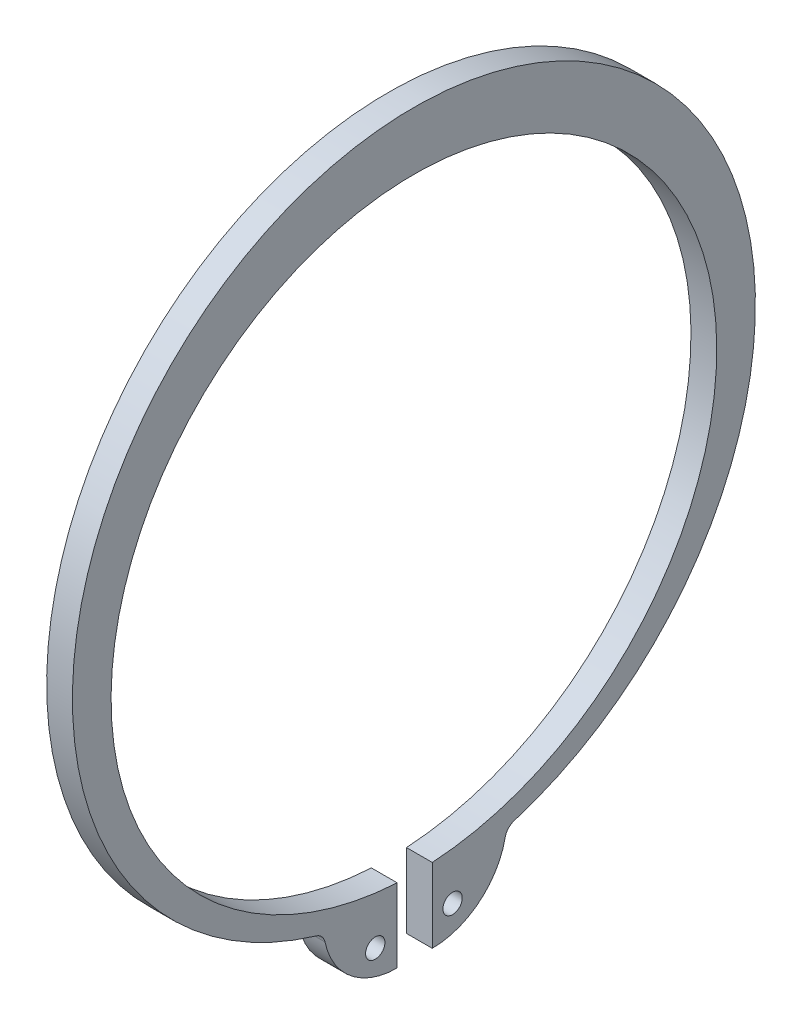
ISO-10303-21;
HEADER;
FILE_DESCRIPTION(('STEP AP214'),'2;1');
FILE_NAME('part.step','',(''),(''),'','','');
FILE_SCHEMA(('AUTOMOTIVE_DESIGN { 1 0 10303 214 1 1 1 1 }'));
ENDSEC;
DATA;
#1=APPLICATION_CONTEXT('core data for automotive mechanical design processes');
#2=APPLICATION_PROTOCOL_DEFINITION('international standard','automotive_design',2000,#1);
#3=PRODUCT_CONTEXT('',#1,'mechanical');
#4=PRODUCT('Part','Part','',(#3));
#5=PRODUCT_RELATED_PRODUCT_CATEGORY('part','',(#4));
#6=PRODUCT_DEFINITION_FORMATION('','',#4);
#7=PRODUCT_DEFINITION_CONTEXT('part definition',#1,'design');
#8=PRODUCT_DEFINITION('design','',#6,#7);
#9=PRODUCT_DEFINITION_SHAPE('','',#8);
#10=(LENGTH_UNIT() NAMED_UNIT(*) SI_UNIT(.MILLI.,.METRE.));
#11=(NAMED_UNIT(*) PLANE_ANGLE_UNIT() SI_UNIT($,.RADIAN.));
#12=(NAMED_UNIT(*) SI_UNIT($,.STERADIAN.) SOLID_ANGLE_UNIT());
#13=UNCERTAINTY_MEASURE_WITH_UNIT(LENGTH_MEASURE(1.E-05),#10,'distance_accuracy_value','');
#14=(GEOMETRIC_REPRESENTATION_CONTEXT(3) GLOBAL_UNCERTAINTY_ASSIGNED_CONTEXT((#13)) GLOBAL_UNIT_ASSIGNED_CONTEXT((#10,
#11,#12)) REPRESENTATION_CONTEXT('',''));
#15=CARTESIAN_POINT('',(0.,0.,0.));
#16=DIRECTION('',(0.,0.,1.));
#17=DIRECTION('',(1.,0.,0.));
#18=AXIS2_PLACEMENT_3D('',#15,#16,#17);
#19=CARTESIAN_POINT('',(2.,-24.8470590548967,7.87924356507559));
#20=DIRECTION('',(-1.,0.,0.));
#21=DIRECTION('',(0.,0.,1.));
#22=AXIS2_PLACEMENT_3D('',#19,#20,#21);
#23=PLANE('',#22);
#24=CARTESIAN_POINT('',(2.,-27.,3.));
#25=DIRECTION('',(1.,0.,0.));
#26=DIRECTION('',(0.,0.,-1.));
#27=AXIS2_PLACEMENT_3D('',#24,#25,#26);
#28=CIRCLE('',#27,0.750000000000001);
#29=CARTESIAN_POINT('',(2.,-27.,2.25));
#30=VERTEX_POINT('',#29);
#31=EDGE_CURVE('E115',#30,#30,#28,.T.);
#32=ORIENTED_EDGE('',*,*,#31,.F.);
#33=EDGE_LOOP('',(#32));
#34=FACE_BOUND('',#33,.T.);
#35=CARTESIAN_POINT('',(2.,-24.8470590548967,7.87924356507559));
#36=DIRECTION('',(-1.,0.,0.));
#37=DIRECTION('',(0.,0.,1.));
#38=AXIS2_PLACEMENT_3D('',#35,#36,#37);
#39=CIRCLE('',#38,1.);
#40=CARTESIAN_POINT('',(2.,-23.8889841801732,7.59272561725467));
#41=VERTEX_POINT('',#40);
#42=CARTESIAN_POINT('',(2.,-24.6414191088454,6.90061584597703));
#43=VERTEX_POINT('',#42);
#44=EDGE_CURVE('E133',#41,#43,#39,.T.);
#45=ORIENTED_EDGE('',*,*,#44,.T.);
#46=CARTESIAN_POINT('',(2.,-23.4641279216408,1.29796027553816));
#47=DIRECTION('',(1.,0.,0.));
#48=DIRECTION('',(0.,0.,-1.));
#49=AXIS2_PLACEMENT_3D('',#46,#47,#48);
#50=CIRCLE('',#49,5.72501213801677);
#51=CARTESIAN_POINT('',(2.,-29.1891400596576,1.29796027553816));
#52=VERTEX_POINT('',#51);
#53=EDGE_CURVE('E110',#43,#52,#50,.T.);
#54=ORIENTED_EDGE('',*,*,#53,.T.);
#55=DIRECTION('',(0.,1.,0.));
#56=VECTOR('',#55,1.);
#57=CARTESIAN_POINT('',(2.,-23.4641279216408,1.29796027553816));
#58=LINE('',#57,#56);
#59=CARTESIAN_POINT('',(2.,-23.4641279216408,1.29796027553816));
#60=VERTEX_POINT('',#59);
#61=EDGE_CURVE('E136',#52,#60,#58,.T.);
#62=ORIENTED_EDGE('',*,*,#61,.T.);
#63=CARTESIAN_POINT('',(2.,0.,0.));
#64=DIRECTION('',(-1.,0.,0.));
#65=DIRECTION('',(0.,0.,-1.));
#66=AXIS2_PLACEMENT_3D('',#63,#64,#65);
#67=CIRCLE('',#66,23.5);
#68=CARTESIAN_POINT('',(2.,-23.4568014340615,-1.42424242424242));
#69=VERTEX_POINT('',#68);
#70=EDGE_CURVE('E138',#60,#69,#67,.T.);
#71=ORIENTED_EDGE('',*,*,#70,.T.);
#72=DIRECTION('',(0.,-1.,0.));
#73=VECTOR('',#72,1.);
#74=CARTESIAN_POINT('',(2.,-23.4568014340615,-1.42424242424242));
#75=LINE('',#74,#73);
#76=CARTESIAN_POINT('',(2.,-29.2306070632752,-1.42424242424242));
#77=VERTEX_POINT('',#76);
#78=EDGE_CURVE('E140',#69,#77,#75,.T.);
#79=ORIENTED_EDGE('',*,*,#78,.T.);
#80=CARTESIAN_POINT('',(2.,-23.4568014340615,-1.42424242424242));
#81=DIRECTION('',(1.,0.,0.));
#82=DIRECTION('',(0.,0.,-1.));
#83=AXIS2_PLACEMENT_3D('',#80,#81,#82);
#84=CIRCLE('',#83,5.77380562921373);
#85=CARTESIAN_POINT('',(2.,-24.5937486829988,-7.08500053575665));
#86=VERTEX_POINT('',#85);
#87=EDGE_CURVE('E142',#77,#86,#84,.T.);
#88=ORIENTED_EDGE('',*,*,#87,.T.);
#89=CARTESIAN_POINT('',(2.,-24.7906633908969,-8.06542115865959));
#90=DIRECTION('',(-1.,0.,0.));
#91=DIRECTION('',(0.,0.,-1.));
#92=AXIS2_PLACEMENT_3D('',#89,#90,#91);
#93=CIRCLE('',#92,1.);
#94=CARTESIAN_POINT('',(2.,-23.8346392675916,-7.7721331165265));
#95=VERTEX_POINT('',#94);
#96=EDGE_CURVE('E51',#86,#95,#93,.T.);
#97=ORIENTED_EDGE('',*,*,#96,.T.);
#98=CARTESIAN_POINT('',(2.,1.5,0.));
#99=DIRECTION('',(1.,0.,0.));
#100=DIRECTION('',(0.,0.,-1.));
#101=AXIS2_PLACEMENT_3D('',#98,#99,#100);
#102=CIRCLE('',#101,26.5);
#103=EDGE_CURVE('E46',#95,#41,#102,.T.);
#104=ORIENTED_EDGE('',*,*,#103,.T.);
#105=EDGE_LOOP('',(#45,#54,#62,#71,#79,#88,#97,#104));
#106=FACE_BOUND('',#105,.T.);
#107=CARTESIAN_POINT('',(2.,-27.,-3.));
#108=DIRECTION('',(1.,0.,0.));
#109=DIRECTION('',(0.,0.,-1.));
#110=AXIS2_PLACEMENT_3D('',#107,#108,#109);
#111=CIRCLE('',#110,0.750000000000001);
#112=CARTESIAN_POINT('',(2.,-27.,-3.75));
#113=VERTEX_POINT('',#112);
#114=EDGE_CURVE('E213',#113,#113,#111,.T.);
#115=ORIENTED_EDGE('',*,*,#114,.F.);
#116=EDGE_LOOP('',(#115));
#117=FACE_BOUND('',#116,.T.);
#118=ADVANCED_FACE('F31',(#34,#106,#117),#23,.F.);
#119=CARTESIAN_POINT('',(0.,-24.8470590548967,7.87924356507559));
#120=DIRECTION('',(-1.,0.,0.));
#121=DIRECTION('',(0.,0.,1.));
#122=AXIS2_PLACEMENT_3D('',#119,#120,#121);
#123=PLANE('',#122);
#124=CARTESIAN_POINT('',(0.,-27.,3.));
#125=DIRECTION('',(1.,0.,0.));
#126=DIRECTION('',(0.,0.,-1.));
#127=AXIS2_PLACEMENT_3D('',#124,#125,#126);
#128=CIRCLE('',#127,0.750000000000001);
#129=CARTESIAN_POINT('',(0.,-27.,2.25));
#130=VERTEX_POINT('',#129);
#131=EDGE_CURVE('E118',#130,#130,#128,.T.);
#132=ORIENTED_EDGE('',*,*,#131,.T.);
#133=EDGE_LOOP('',(#132));
#134=FACE_BOUND('',#133,.T.);
#135=CARTESIAN_POINT('',(0.,-24.8470590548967,7.87924356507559));
#136=DIRECTION('',(-1.,0.,0.));
#137=DIRECTION('',(0.,0.,1.));
#138=AXIS2_PLACEMENT_3D('',#135,#136,#137);
#139=CIRCLE('',#138,1.);
#140=CARTESIAN_POINT('',(0.,-23.8889841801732,7.59272561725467));
#141=VERTEX_POINT('',#140);
#142=CARTESIAN_POINT('',(0.,-24.6414191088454,6.90061584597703));
#143=VERTEX_POINT('',#142);
#144=EDGE_CURVE('E101',#141,#143,#139,.T.);
#145=ORIENTED_EDGE('',*,*,#144,.F.);
#146=CARTESIAN_POINT('',(0.,1.5,0.));
#147=DIRECTION('',(1.,0.,0.));
#148=DIRECTION('',(0.,0.,-1.));
#149=AXIS2_PLACEMENT_3D('',#146,#147,#148);
#150=CIRCLE('',#149,26.5);
#151=CARTESIAN_POINT('',(0.,-23.8346392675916,-7.7721331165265));
#152=VERTEX_POINT('',#151);
#153=EDGE_CURVE('E131',#152,#141,#150,.T.);
#154=ORIENTED_EDGE('',*,*,#153,.F.);
#155=CARTESIAN_POINT('',(0.,-24.7906633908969,-8.06542115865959));
#156=DIRECTION('',(-1.,0.,0.));
#157=DIRECTION('',(0.,0.,-1.));
#158=AXIS2_PLACEMENT_3D('',#155,#156,#157);
#159=CIRCLE('',#158,1.);
#160=CARTESIAN_POINT('',(0.,-24.5937486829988,-7.08500053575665));
#161=VERTEX_POINT('',#160);
#162=EDGE_CURVE('E129',#161,#152,#159,.T.);
#163=ORIENTED_EDGE('',*,*,#162,.F.);
#164=CARTESIAN_POINT('',(0.,-23.4568014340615,-1.42424242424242));
#165=DIRECTION('',(1.,0.,0.));
#166=DIRECTION('',(0.,0.,-1.));
#167=AXIS2_PLACEMENT_3D('',#164,#165,#166);
#168=CIRCLE('',#167,5.77380562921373);
#169=CARTESIAN_POINT('',(0.,-29.2306070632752,-1.42424242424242));
#170=VERTEX_POINT('',#169);
#171=EDGE_CURVE('E127',#170,#161,#168,.T.);
#172=ORIENTED_EDGE('',*,*,#171,.F.);
#173=DIRECTION('',(0.,-1.,0.));
#174=VECTOR('',#173,1.);
#175=CARTESIAN_POINT('',(0.,-23.4568014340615,-1.42424242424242));
#176=LINE('',#175,#174);
#177=CARTESIAN_POINT('',(0.,-23.4568014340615,-1.42424242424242));
#178=VERTEX_POINT('',#177);
#179=EDGE_CURVE('E125',#178,#170,#176,.T.);
#180=ORIENTED_EDGE('',*,*,#179,.F.);
#181=CARTESIAN_POINT('',(0.,0.,0.));
#182=DIRECTION('',(-1.,0.,0.));
#183=DIRECTION('',(0.,0.,-1.));
#184=AXIS2_PLACEMENT_3D('',#181,#182,#183);
#185=CIRCLE('',#184,23.5);
#186=CARTESIAN_POINT('',(0.,-23.4641279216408,1.29796027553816));
#187=VERTEX_POINT('',#186);
#188=EDGE_CURVE('E123',#187,#178,#185,.T.);
#189=ORIENTED_EDGE('',*,*,#188,.F.);
#190=DIRECTION('',(0.,1.,0.));
#191=VECTOR('',#190,1.);
#192=CARTESIAN_POINT('',(0.,-23.4641279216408,1.29796027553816));
#193=LINE('',#192,#191);
#194=CARTESIAN_POINT('',(0.,-29.1891400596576,1.29796027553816));
#195=VERTEX_POINT('',#194);
#196=EDGE_CURVE('E103',#195,#187,#193,.T.);
#197=ORIENTED_EDGE('',*,*,#196,.F.);
#198=CARTESIAN_POINT('',(0.,-23.4641279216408,1.29796027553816));
#199=DIRECTION('',(1.,0.,0.));
#200=DIRECTION('',(0.,0.,-1.));
#201=AXIS2_PLACEMENT_3D('',#198,#199,#200);
#202=CIRCLE('',#201,5.72501213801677);
#203=EDGE_CURVE('E96',#143,#195,#202,.T.);
#204=ORIENTED_EDGE('',*,*,#203,.F.);
#205=EDGE_LOOP('',(#145,#154,#163,#172,#180,#189,#197,#204));
#206=FACE_BOUND('',#205,.T.);
#207=CARTESIAN_POINT('',(0.,-27.,-3.));
#208=DIRECTION('',(1.,0.,0.));
#209=DIRECTION('',(0.,0.,-1.));
#210=AXIS2_PLACEMENT_3D('',#207,#208,#209);
#211=CIRCLE('',#210,0.750000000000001);
#212=CARTESIAN_POINT('',(0.,-27.,-3.75));
#213=VERTEX_POINT('',#212);
#214=EDGE_CURVE('E216',#213,#213,#211,.T.);
#215=ORIENTED_EDGE('',*,*,#214,.T.);
#216=EDGE_LOOP('',(#215));
#217=FACE_BOUND('',#216,.T.);
#218=ADVANCED_FACE('F97',(#134,#206,#217),#123,.T.);
#219=CARTESIAN_POINT('',(2.,-24.8470590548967,7.87924356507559));
#220=DIRECTION('',(-1.,0.,0.));
#221=DIRECTION('',(0.,0.,1.));
#222=AXIS2_PLACEMENT_3D('',#219,#220,#221);
#223=CYLINDRICAL_SURFACE('',#222,1.);
#224=ORIENTED_EDGE('',*,*,#144,.T.);
#225=DIRECTION('',(-1.,0.,0.));
#226=VECTOR('',#225,1.);
#227=CARTESIAN_POINT('',(2.,-24.6414191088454,6.90061584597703));
#228=LINE('',#227,#226);
#229=EDGE_CURVE('E11',#43,#143,#228,.T.);
#230=ORIENTED_EDGE('',*,*,#229,.F.);
#231=ORIENTED_EDGE('',*,*,#44,.F.);
#232=DIRECTION('',(-1.,0.,0.));
#233=VECTOR('',#232,1.);
#234=CARTESIAN_POINT('',(2.,-23.8889841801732,7.59272561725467));
#235=LINE('',#234,#233);
#236=EDGE_CURVE('E114',#41,#141,#235,.T.);
#237=ORIENTED_EDGE('',*,*,#236,.T.);
#238=EDGE_LOOP('',(#224,#230,#231,#237));
#239=FACE_BOUND('',#238,.T.);
#240=ADVANCED_FACE('F33',(#239),#223,.F.);
#241=CARTESIAN_POINT('',(2.,-23.4641279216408,1.29796027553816));
#242=DIRECTION('',(-1.,0.,0.));
#243=DIRECTION('',(0.,0.,1.));
#244=AXIS2_PLACEMENT_3D('',#241,#242,#243);
#245=CYLINDRICAL_SURFACE('',#244,5.72501213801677);
#246=ORIENTED_EDGE('',*,*,#203,.T.);
#247=DIRECTION('',(-1.,0.,0.));
#248=VECTOR('',#247,1.);
#249=CARTESIAN_POINT('',(2.,-29.1891400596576,1.29796027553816));
#250=LINE('',#249,#248);
#251=EDGE_CURVE('E39',#52,#195,#250,.T.);
#252=ORIENTED_EDGE('',*,*,#251,.F.);
#253=ORIENTED_EDGE('',*,*,#53,.F.);
#254=ORIENTED_EDGE('',*,*,#229,.T.);
#255=EDGE_LOOP('',(#246,#252,#253,#254));
#256=FACE_BOUND('',#255,.T.);
#257=ADVANCED_FACE('F109',(#256),#245,.T.);
#258=CARTESIAN_POINT('',(2.,-23.4641279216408,1.29796027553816));
#259=DIRECTION('',(0.,0.,1.));
#260=DIRECTION('',(1.,0.,0.));
#261=AXIS2_PLACEMENT_3D('',#258,#259,#260);
#262=PLANE('',#261);
#263=ORIENTED_EDGE('',*,*,#196,.T.);
#264=DIRECTION('',(-1.,0.,0.));
#265=VECTOR('',#264,1.);
#266=CARTESIAN_POINT('',(2.,-23.4641279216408,1.29796027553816));
#267=LINE('',#266,#265);
#268=EDGE_CURVE('E159',#60,#187,#267,.T.);
#269=ORIENTED_EDGE('',*,*,#268,.F.);
#270=ORIENTED_EDGE('',*,*,#61,.F.);
#271=ORIENTED_EDGE('',*,*,#251,.T.);
#272=EDGE_LOOP('',(#263,#269,#270,#271));
#273=FACE_BOUND('',#272,.T.);
#274=ADVANCED_FACE('F163',(#273),#262,.F.);
#275=CARTESIAN_POINT('',(2.,0.,0.));
#276=DIRECTION('',(-1.,0.,0.));
#277=DIRECTION('',(0.,0.,1.));
#278=AXIS2_PLACEMENT_3D('',#275,#276,#277);
#279=CYLINDRICAL_SURFACE('',#278,23.5);
#280=ORIENTED_EDGE('',*,*,#188,.T.);
#281=DIRECTION('',(-1.,0.,0.));
#282=VECTOR('',#281,1.);
#283=CARTESIAN_POINT('',(2.,-23.4568014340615,-1.42424242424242));
#284=LINE('',#283,#282);
#285=EDGE_CURVE('E156',#69,#178,#284,.T.);
#286=ORIENTED_EDGE('',*,*,#285,.F.);
#287=ORIENTED_EDGE('',*,*,#70,.F.);
#288=ORIENTED_EDGE('',*,*,#268,.T.);
#289=EDGE_LOOP('',(#280,#286,#287,#288));
#290=FACE_BOUND('',#289,.T.);
#291=ADVANCED_FACE('F171',(#290),#279,.F.);
#292=CARTESIAN_POINT('',(2.,-23.4568014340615,-1.42424242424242));
#293=DIRECTION('',(0.,0.,-1.));
#294=DIRECTION('',(0.,1.,0.));
#295=AXIS2_PLACEMENT_3D('',#292,#293,#294);
#296=PLANE('',#295);
#297=ORIENTED_EDGE('',*,*,#179,.T.);
#298=DIRECTION('',(-1.,0.,0.));
#299=VECTOR('',#298,1.);
#300=CARTESIAN_POINT('',(2.,-29.2306070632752,-1.42424242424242));
#301=LINE('',#300,#299);
#302=EDGE_CURVE('E153',#77,#170,#301,.T.);
#303=ORIENTED_EDGE('',*,*,#302,.F.);
#304=ORIENTED_EDGE('',*,*,#78,.F.);
#305=ORIENTED_EDGE('',*,*,#285,.T.);
#306=EDGE_LOOP('',(#297,#303,#304,#305));
#307=FACE_BOUND('',#306,.T.);
#308=ADVANCED_FACE('F174',(#307),#296,.F.);
#309=CARTESIAN_POINT('',(2.,-23.4568014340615,-1.42424242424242));
#310=DIRECTION('',(-1.,0.,0.));
#311=DIRECTION('',(0.,0.,1.));
#312=AXIS2_PLACEMENT_3D('',#309,#310,#311);
#313=CYLINDRICAL_SURFACE('',#312,5.77380562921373);
#314=ORIENTED_EDGE('',*,*,#171,.T.);
#315=DIRECTION('',(-1.,0.,0.));
#316=VECTOR('',#315,1.);
#317=CARTESIAN_POINT('',(2.,-24.5937486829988,-7.08500053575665));
#318=LINE('',#317,#316);
#319=EDGE_CURVE('E150',#86,#161,#318,.T.);
#320=ORIENTED_EDGE('',*,*,#319,.F.);
#321=ORIENTED_EDGE('',*,*,#87,.F.);
#322=ORIENTED_EDGE('',*,*,#302,.T.);
#323=EDGE_LOOP('',(#314,#320,#321,#322));
#324=FACE_BOUND('',#323,.T.);
#325=ADVANCED_FACE('F179',(#324),#313,.T.);
#326=CARTESIAN_POINT('',(2.,-24.7906633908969,-8.06542115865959));
#327=DIRECTION('',(-1.,0.,0.));
#328=DIRECTION('',(0.,0.,1.));
#329=AXIS2_PLACEMENT_3D('',#326,#327,#328);
#330=CYLINDRICAL_SURFACE('',#329,1.);
#331=ORIENTED_EDGE('',*,*,#162,.T.);
#332=DIRECTION('',(-1.,0.,0.));
#333=VECTOR('',#332,1.);
#334=CARTESIAN_POINT('',(2.,-23.8346392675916,-7.7721331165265));
#335=LINE('',#334,#333);
#336=EDGE_CURVE('E147',#95,#152,#335,.T.);
#337=ORIENTED_EDGE('',*,*,#336,.F.);
#338=ORIENTED_EDGE('',*,*,#96,.F.);
#339=ORIENTED_EDGE('',*,*,#319,.T.);
#340=EDGE_LOOP('',(#331,#337,#338,#339));
#341=FACE_BOUND('',#340,.T.);
#342=ADVANCED_FACE('F182',(#341),#330,.F.);
#343=CARTESIAN_POINT('',(2.,1.5,0.));
#344=DIRECTION('',(-1.,0.,0.));
#345=DIRECTION('',(0.,0.,1.));
#346=AXIS2_PLACEMENT_3D('',#343,#344,#345);
#347=CYLINDRICAL_SURFACE('',#346,26.5);
#348=ORIENTED_EDGE('',*,*,#153,.T.);
#349=ORIENTED_EDGE('',*,*,#236,.F.);
#350=ORIENTED_EDGE('',*,*,#103,.F.);
#351=ORIENTED_EDGE('',*,*,#336,.T.);
#352=EDGE_LOOP('',(#348,#349,#350,#351));
#353=FACE_BOUND('',#352,.T.);
#354=ADVANCED_FACE('F184',(#353),#347,.T.);
#355=CARTESIAN_POINT('',(2.,-27.,3.));
#356=DIRECTION('',(-1.,0.,0.));
#357=DIRECTION('',(0.,0.,1.));
#358=AXIS2_PLACEMENT_3D('',#355,#356,#357);
#359=CYLINDRICAL_SURFACE('',#358,0.750000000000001);
#360=ORIENTED_EDGE('',*,*,#31,.T.);
#361=EDGE_LOOP('',(#360));
#362=FACE_BOUND('',#361,.T.);
#363=ORIENTED_EDGE('',*,*,#131,.F.);
#364=EDGE_LOOP('',(#363));
#365=FACE_BOUND('',#364,.T.);
#366=ADVANCED_FACE('F186',(#362,#365),#359,.F.);
#367=CARTESIAN_POINT('',(2.,-27.,-3.));
#368=DIRECTION('',(-1.,0.,0.));
#369=DIRECTION('',(0.,0.,1.));
#370=AXIS2_PLACEMENT_3D('',#367,#368,#369);
#371=CYLINDRICAL_SURFACE('',#370,0.750000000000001);
#372=ORIENTED_EDGE('',*,*,#114,.T.);
#373=EDGE_LOOP('',(#372));
#374=FACE_BOUND('',#373,.T.);
#375=ORIENTED_EDGE('',*,*,#214,.F.);
#376=EDGE_LOOP('',(#375));
#377=FACE_BOUND('',#376,.T.);
#378=ADVANCED_FACE('F192',(#374,#377),#371,.F.);
#379=CLOSED_SHELL('',(#118,#218,#240,#257,#274,#291,#308,#325,#342,#354,#366,#378));
#380=MANIFOLD_SOLID_BREP('B2',#379);
#381=ADVANCED_BREP_SHAPE_REPRESENTATION('',(#18,#380),#14);
#382=SHAPE_DEFINITION_REPRESENTATION(#9,#381);
ENDSEC;
END-ISO-10303-21;
